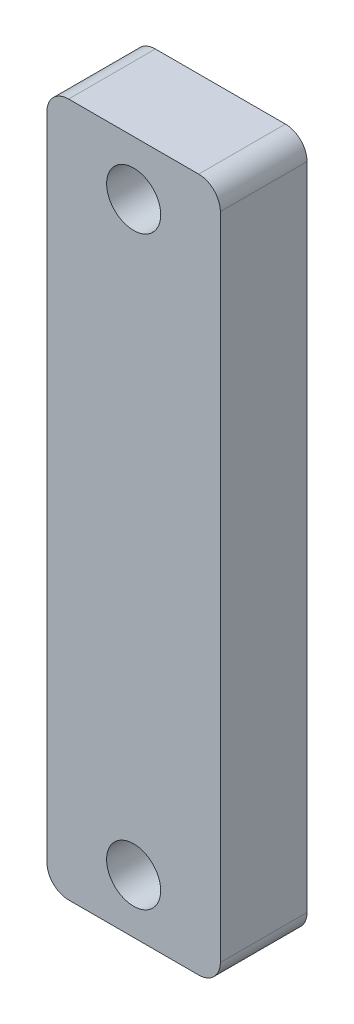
ISO-10303-21;
HEADER;
FILE_DESCRIPTION(('STEP AP214'),'2;1');
FILE_NAME('part.step','',(''),(''),'','','');
FILE_SCHEMA(('AUTOMOTIVE_DESIGN { 1 0 10303 214 1 1 1 1 }'));
ENDSEC;
DATA;
#1=APPLICATION_CONTEXT('core data for automotive mechanical design processes');
#2=APPLICATION_PROTOCOL_DEFINITION('international standard','automotive_design',2000,#1);
#3=PRODUCT_CONTEXT('',#1,'mechanical');
#4=PRODUCT('Part','Part','',(#3));
#5=PRODUCT_RELATED_PRODUCT_CATEGORY('part','',(#4));
#6=PRODUCT_DEFINITION_FORMATION('','',#4);
#7=PRODUCT_DEFINITION_CONTEXT('part definition',#1,'design');
#8=PRODUCT_DEFINITION('design','',#6,#7);
#9=PRODUCT_DEFINITION_SHAPE('','',#8);
#10=(LENGTH_UNIT() NAMED_UNIT(*) SI_UNIT(.MILLI.,.METRE.));
#11=(NAMED_UNIT(*) PLANE_ANGLE_UNIT() SI_UNIT($,.RADIAN.));
#12=(NAMED_UNIT(*) SI_UNIT($,.STERADIAN.) SOLID_ANGLE_UNIT());
#13=UNCERTAINTY_MEASURE_WITH_UNIT(LENGTH_MEASURE(1.E-05),#10,'distance_accuracy_value','');
#14=(GEOMETRIC_REPRESENTATION_CONTEXT(3) GLOBAL_UNCERTAINTY_ASSIGNED_CONTEXT((#13)) GLOBAL_UNIT_ASSIGNED_CONTEXT((#10,
#11,#12)) REPRESENTATION_CONTEXT('',''));
#15=CARTESIAN_POINT('',(0.,0.,0.));
#16=DIRECTION('',(0.,0.,1.));
#17=DIRECTION('',(1.,0.,0.));
#18=AXIS2_PLACEMENT_3D('',#15,#16,#17);
#19=CARTESIAN_POINT('',(0.,0.,12.7));
#20=DIRECTION('',(0.,0.,1.));
#21=DIRECTION('',(1.,0.,0.));
#22=AXIS2_PLACEMENT_3D('',#19,#20,#21);
#23=PLANE('',#22);
#24=CARTESIAN_POINT('',(12.7,7.9248,12.7));
#25=DIRECTION('',(0.,0.,1.));
#26=DIRECTION('',(1.,0.,0.));
#27=AXIS2_PLACEMENT_3D('',#24,#25,#26);
#28=CIRCLE('',#27,3.9624);
#29=CARTESIAN_POINT('',(16.6624,7.9248,12.7));
#30=VERTEX_POINT('',#29);
#31=EDGE_CURVE('E178',#30,#30,#28,.T.);
#32=ORIENTED_EDGE('',*,*,#31,.F.);
#33=EDGE_LOOP('',(#32));
#34=FACE_BOUND('',#33,.T.);
#35=DIRECTION('',(1.,0.,0.));
#36=VECTOR('',#35,1.);
#37=CARTESIAN_POINT('',(0.,0.,12.7));
#38=LINE('',#37,#36);
#39=CARTESIAN_POINT('',(3.175,0.,12.7));
#40=VERTEX_POINT('',#39);
#41=CARTESIAN_POINT('',(22.225,0.,12.7));
#42=VERTEX_POINT('',#41);
#43=EDGE_CURVE('E169',#40,#42,#38,.T.);
#44=ORIENTED_EDGE('',*,*,#43,.T.);
#45=CARTESIAN_POINT('',(22.225,3.175,12.7));
#46=DIRECTION('',(0.,0.,1.));
#47=DIRECTION('',(1.,0.,0.));
#48=AXIS2_PLACEMENT_3D('',#45,#46,#47);
#49=CIRCLE('',#48,3.175);
#50=CARTESIAN_POINT('',(25.4,3.175,12.7));
#51=VERTEX_POINT('',#50);
#52=EDGE_CURVE('E147',#42,#51,#49,.T.);
#53=ORIENTED_EDGE('',*,*,#52,.T.);
#54=DIRECTION('',(0.,1.,0.));
#55=VECTOR('',#54,1.);
#56=CARTESIAN_POINT('',(25.4,0.,12.7));
#57=LINE('',#56,#55);
#58=CARTESIAN_POINT('',(25.4,98.425,12.7));
#59=VERTEX_POINT('',#58);
#60=EDGE_CURVE('E117',#51,#59,#57,.T.);
#61=ORIENTED_EDGE('',*,*,#60,.T.);
#62=CARTESIAN_POINT('',(22.225,98.425,12.7));
#63=DIRECTION('',(0.,0.,1.));
#64=DIRECTION('',(1.,0.,0.));
#65=AXIS2_PLACEMENT_3D('',#62,#63,#64);
#66=CIRCLE('',#65,3.175);
#67=CARTESIAN_POINT('',(22.225,101.6,12.7));
#68=VERTEX_POINT('',#67);
#69=EDGE_CURVE('E53',#59,#68,#66,.T.);
#70=ORIENTED_EDGE('',*,*,#69,.T.);
#71=DIRECTION('',(-1.,0.,0.));
#72=VECTOR('',#71,1.);
#73=CARTESIAN_POINT('',(25.4,101.6,12.7));
#74=LINE('',#73,#72);
#75=CARTESIAN_POINT('',(3.175,101.6,12.7));
#76=VERTEX_POINT('',#75);
#77=EDGE_CURVE('E133',#68,#76,#74,.T.);
#78=ORIENTED_EDGE('',*,*,#77,.T.);
#79=CARTESIAN_POINT('',(3.175,98.425,12.7));
#80=DIRECTION('',(0.,0.,1.));
#81=DIRECTION('',(1.,0.,0.));
#82=AXIS2_PLACEMENT_3D('',#79,#80,#81);
#83=CIRCLE('',#82,3.175);
#84=CARTESIAN_POINT('',(0.,98.425,12.7));
#85=VERTEX_POINT('',#84);
#86=EDGE_CURVE('E143',#76,#85,#83,.T.);
#87=ORIENTED_EDGE('',*,*,#86,.T.);
#88=DIRECTION('',(0.,-1.,0.));
#89=VECTOR('',#88,1.);
#90=CARTESIAN_POINT('',(0.,101.6,12.7));
#91=LINE('',#90,#89);
#92=CARTESIAN_POINT('',(0.,3.175,12.7));
#93=VERTEX_POINT('',#92);
#94=EDGE_CURVE('E127',#85,#93,#91,.T.);
#95=ORIENTED_EDGE('',*,*,#94,.T.);
#96=CARTESIAN_POINT('',(3.175,3.175,12.7));
#97=DIRECTION('',(0.,0.,1.));
#98=DIRECTION('',(1.,0.,0.));
#99=AXIS2_PLACEMENT_3D('',#96,#97,#98);
#100=CIRCLE('',#99,3.175);
#101=EDGE_CURVE('E145',#93,#40,#100,.T.);
#102=ORIENTED_EDGE('',*,*,#101,.T.);
#103=EDGE_LOOP('',(#44,#53,#61,#70,#78,#87,#95,#102));
#104=FACE_BOUND('',#103,.T.);
#105=CARTESIAN_POINT('',(12.7,93.6498,12.7));
#106=DIRECTION('',(0.,0.,1.));
#107=DIRECTION('',(1.,0.,0.));
#108=AXIS2_PLACEMENT_3D('',#105,#106,#107);
#109=CIRCLE('',#108,3.96239999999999);
#110=CARTESIAN_POINT('',(16.6624,93.6498,12.7));
#111=VERTEX_POINT('',#110);
#112=EDGE_CURVE('E183',#111,#111,#109,.T.);
#113=ORIENTED_EDGE('',*,*,#112,.F.);
#114=EDGE_LOOP('',(#113));
#115=FACE_BOUND('',#114,.T.);
#116=ADVANCED_FACE('F33',(#34,#104,#115),#23,.T.);
#117=CARTESIAN_POINT('',(0.,0.,0.));
#118=DIRECTION('',(0.,0.,1.));
#119=DIRECTION('',(1.,0.,0.));
#120=AXIS2_PLACEMENT_3D('',#117,#118,#119);
#121=PLANE('',#120);
#122=CARTESIAN_POINT('',(12.7,7.9248,0.));
#123=DIRECTION('',(0.,0.,1.));
#124=DIRECTION('',(1.,0.,0.));
#125=AXIS2_PLACEMENT_3D('',#122,#123,#124);
#126=CIRCLE('',#125,3.9624);
#127=CARTESIAN_POINT('',(16.6624,7.9248,0.));
#128=VERTEX_POINT('',#127);
#129=EDGE_CURVE('E174',#128,#128,#126,.T.);
#130=ORIENTED_EDGE('',*,*,#129,.T.);
#131=EDGE_LOOP('',(#130));
#132=FACE_BOUND('',#131,.T.);
#133=DIRECTION('',(0.,1.,0.));
#134=VECTOR('',#133,1.);
#135=CARTESIAN_POINT('',(25.4,0.,0.));
#136=LINE('',#135,#134);
#137=CARTESIAN_POINT('',(25.4,3.175,0.));
#138=VERTEX_POINT('',#137);
#139=CARTESIAN_POINT('',(25.4,98.425,0.));
#140=VERTEX_POINT('',#139);
#141=EDGE_CURVE('E115',#138,#140,#136,.T.);
#142=ORIENTED_EDGE('',*,*,#141,.F.);
#143=CARTESIAN_POINT('',(22.225,3.175,0.));
#144=DIRECTION('',(0.,0.,1.));
#145=DIRECTION('',(1.,0.,0.));
#146=AXIS2_PLACEMENT_3D('',#143,#144,#145);
#147=CIRCLE('',#146,3.175);
#148=CARTESIAN_POINT('',(22.225,0.,0.));
#149=VERTEX_POINT('',#148);
#150=EDGE_CURVE('E98',#138,#149,#147,.F.);
#151=ORIENTED_EDGE('',*,*,#150,.T.);
#152=DIRECTION('',(1.,0.,0.));
#153=VECTOR('',#152,1.);
#154=CARTESIAN_POINT('',(0.,0.,0.));
#155=LINE('',#154,#153);
#156=CARTESIAN_POINT('',(3.175,0.,0.));
#157=VERTEX_POINT('',#156);
#158=EDGE_CURVE('E125',#157,#149,#155,.T.);
#159=ORIENTED_EDGE('',*,*,#158,.F.);
#160=CARTESIAN_POINT('',(3.175,3.175,0.));
#161=DIRECTION('',(0.,0.,1.));
#162=DIRECTION('',(1.,0.,0.));
#163=AXIS2_PLACEMENT_3D('',#160,#161,#162);
#164=CIRCLE('',#163,3.175);
#165=CARTESIAN_POINT('',(0.,3.175,0.));
#166=VERTEX_POINT('',#165);
#167=EDGE_CURVE('E109',#157,#166,#164,.F.);
#168=ORIENTED_EDGE('',*,*,#167,.T.);
#169=DIRECTION('',(0.,-1.,0.));
#170=VECTOR('',#169,1.);
#171=CARTESIAN_POINT('',(0.,101.6,0.));
#172=LINE('',#171,#170);
#173=CARTESIAN_POINT('',(0.,98.425,0.));
#174=VERTEX_POINT('',#173);
#175=EDGE_CURVE('E129',#174,#166,#172,.T.);
#176=ORIENTED_EDGE('',*,*,#175,.F.);
#177=CARTESIAN_POINT('',(3.175,98.425,0.));
#178=DIRECTION('',(0.,0.,1.));
#179=DIRECTION('',(1.,0.,0.));
#180=AXIS2_PLACEMENT_3D('',#177,#178,#179);
#181=CIRCLE('',#180,3.175);
#182=CARTESIAN_POINT('',(3.175,101.6,0.));
#183=VERTEX_POINT('',#182);
#184=EDGE_CURVE('E136',#174,#183,#181,.F.);
#185=ORIENTED_EDGE('',*,*,#184,.T.);
#186=DIRECTION('',(-1.,0.,0.));
#187=VECTOR('',#186,1.);
#188=CARTESIAN_POINT('',(25.4,101.6,0.));
#189=LINE('',#188,#187);
#190=CARTESIAN_POINT('',(22.225,101.6,0.));
#191=VERTEX_POINT('',#190);
#192=EDGE_CURVE('E124',#191,#183,#189,.T.);
#193=ORIENTED_EDGE('',*,*,#192,.F.);
#194=CARTESIAN_POINT('',(22.225,98.425,0.));
#195=DIRECTION('',(0.,0.,1.));
#196=DIRECTION('',(1.,0.,0.));
#197=AXIS2_PLACEMENT_3D('',#194,#195,#196);
#198=CIRCLE('',#197,3.175);
#199=EDGE_CURVE('E118',#191,#140,#198,.F.);
#200=ORIENTED_EDGE('',*,*,#199,.T.);
#201=EDGE_LOOP('',(#142,#151,#159,#168,#176,#185,#193,#200));
#202=FACE_BOUND('',#201,.T.);
#203=CARTESIAN_POINT('',(12.7,93.6498,0.));
#204=DIRECTION('',(0.,0.,1.));
#205=DIRECTION('',(1.,0.,0.));
#206=AXIS2_PLACEMENT_3D('',#203,#204,#205);
#207=CIRCLE('',#206,3.96239999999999);
#208=CARTESIAN_POINT('',(16.6624,93.6498,0.));
#209=VERTEX_POINT('',#208);
#210=EDGE_CURVE('E185',#209,#209,#207,.T.);
#211=ORIENTED_EDGE('',*,*,#210,.T.);
#212=EDGE_LOOP('',(#211));
#213=FACE_BOUND('',#212,.T.);
#214=ADVANCED_FACE('F121',(#132,#202,#213),#121,.F.);
#215=CARTESIAN_POINT('',(0.,101.6,12.7));
#216=DIRECTION('',(1.,0.,0.));
#217=DIRECTION('',(0.,0.,-1.));
#218=AXIS2_PLACEMENT_3D('',#215,#216,#217);
#219=PLANE('',#218);
#220=ORIENTED_EDGE('',*,*,#175,.T.);
#221=DIRECTION('',(0.,0.,-1.));
#222=VECTOR('',#221,1.);
#223=CARTESIAN_POINT('',(0.,3.175,12.7));
#224=LINE('',#223,#222);
#225=EDGE_CURVE('E152',#166,#93,#224,.F.);
#226=ORIENTED_EDGE('',*,*,#225,.T.);
#227=ORIENTED_EDGE('',*,*,#94,.F.);
#228=DIRECTION('',(0.,0.,-1.));
#229=VECTOR('',#228,1.);
#230=CARTESIAN_POINT('',(0.,98.425,12.7));
#231=LINE('',#230,#229);
#232=EDGE_CURVE('E149',#85,#174,#231,.T.);
#233=ORIENTED_EDGE('',*,*,#232,.T.);
#234=EDGE_LOOP('',(#220,#226,#227,#233));
#235=FACE_BOUND('',#234,.T.);
#236=ADVANCED_FACE('F165',(#235),#219,.F.);
#237=CARTESIAN_POINT('',(0.,0.,12.7));
#238=DIRECTION('',(0.,1.,0.));
#239=DIRECTION('',(0.,0.,1.));
#240=AXIS2_PLACEMENT_3D('',#237,#238,#239);
#241=PLANE('',#240);
#242=ORIENTED_EDGE('',*,*,#158,.T.);
#243=DIRECTION('',(0.,0.,-1.));
#244=VECTOR('',#243,1.);
#245=CARTESIAN_POINT('',(22.225,0.,12.7));
#246=LINE('',#245,#244);
#247=EDGE_CURVE('E103',#149,#42,#246,.F.);
#248=ORIENTED_EDGE('',*,*,#247,.T.);
#249=ORIENTED_EDGE('',*,*,#43,.F.);
#250=DIRECTION('',(0.,0.,-1.));
#251=VECTOR('',#250,1.);
#252=CARTESIAN_POINT('',(3.175,0.,12.7));
#253=LINE('',#252,#251);
#254=EDGE_CURVE('E108',#40,#157,#253,.T.);
#255=ORIENTED_EDGE('',*,*,#254,.T.);
#256=EDGE_LOOP('',(#242,#248,#249,#255));
#257=FACE_BOUND('',#256,.T.);
#258=ADVANCED_FACE('F210',(#257),#241,.F.);
#259=CARTESIAN_POINT('',(25.4,0.,12.7));
#260=DIRECTION('',(-1.,0.,0.));
#261=DIRECTION('',(0.,0.,1.));
#262=AXIS2_PLACEMENT_3D('',#259,#260,#261);
#263=PLANE('',#262);
#264=ORIENTED_EDGE('',*,*,#60,.F.);
#265=DIRECTION('',(0.,0.,-1.));
#266=VECTOR('',#265,1.);
#267=CARTESIAN_POINT('',(25.4,3.175,12.7));
#268=LINE('',#267,#266);
#269=EDGE_CURVE('E102',#51,#138,#268,.T.);
#270=ORIENTED_EDGE('',*,*,#269,.T.);
#271=ORIENTED_EDGE('',*,*,#141,.T.);
#272=DIRECTION('',(0.,0.,-1.));
#273=VECTOR('',#272,1.);
#274=CARTESIAN_POINT('',(25.4,98.425,12.7));
#275=LINE('',#274,#273);
#276=EDGE_CURVE('E119',#140,#59,#275,.F.);
#277=ORIENTED_EDGE('',*,*,#276,.T.);
#278=EDGE_LOOP('',(#264,#270,#271,#277));
#279=FACE_BOUND('',#278,.T.);
#280=ADVANCED_FACE('F114',(#279),#263,.F.);
#281=CARTESIAN_POINT('',(25.4,101.6,12.7));
#282=DIRECTION('',(0.,-1.,0.));
#283=DIRECTION('',(0.,0.,-1.));
#284=AXIS2_PLACEMENT_3D('',#281,#282,#283);
#285=PLANE('',#284);
#286=ORIENTED_EDGE('',*,*,#192,.T.);
#287=DIRECTION('',(0.,0.,-1.));
#288=VECTOR('',#287,1.);
#289=CARTESIAN_POINT('',(3.175,101.6,12.7));
#290=LINE('',#289,#288);
#291=EDGE_CURVE('E11',#183,#76,#290,.F.);
#292=ORIENTED_EDGE('',*,*,#291,.T.);
#293=ORIENTED_EDGE('',*,*,#77,.F.);
#294=DIRECTION('',(0.,0.,-1.));
#295=VECTOR('',#294,1.);
#296=CARTESIAN_POINT('',(22.225,101.6,12.7));
#297=LINE('',#296,#295);
#298=EDGE_CURVE('E41',#68,#191,#297,.T.);
#299=ORIENTED_EDGE('',*,*,#298,.T.);
#300=EDGE_LOOP('',(#286,#292,#293,#299));
#301=FACE_BOUND('',#300,.T.);
#302=ADVANCED_FACE('F155',(#301),#285,.F.);
#303=CARTESIAN_POINT('',(12.7,7.9248,12.7));
#304=DIRECTION('',(0.,0.,-1.));
#305=DIRECTION('',(-1.,0.,0.));
#306=AXIS2_PLACEMENT_3D('',#303,#304,#305);
#307=CYLINDRICAL_SURFACE('',#306,3.9624);
#308=ORIENTED_EDGE('',*,*,#31,.T.);
#309=EDGE_LOOP('',(#308));
#310=FACE_BOUND('',#309,.T.);
#311=ORIENTED_EDGE('',*,*,#129,.F.);
#312=EDGE_LOOP('',(#311));
#313=FACE_BOUND('',#312,.T.);
#314=ADVANCED_FACE('F203',(#310,#313),#307,.F.);
#315=CARTESIAN_POINT('',(12.7,93.6498,12.7));
#316=DIRECTION('',(0.,0.,-1.));
#317=DIRECTION('',(-1.,0.,0.));
#318=AXIS2_PLACEMENT_3D('',#315,#316,#317);
#319=CYLINDRICAL_SURFACE('',#318,3.96239999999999);
#320=ORIENTED_EDGE('',*,*,#112,.T.);
#321=EDGE_LOOP('',(#320));
#322=FACE_BOUND('',#321,.T.);
#323=ORIENTED_EDGE('',*,*,#210,.F.);
#324=EDGE_LOOP('',(#323));
#325=FACE_BOUND('',#324,.T.);
#326=ADVANCED_FACE('F191',(#322,#325),#319,.F.);
#327=CARTESIAN_POINT('',(22.225,3.175,12.7));
#328=DIRECTION('',(0.,0.,-1.));
#329=DIRECTION('',(-1.,0.,0.));
#330=AXIS2_PLACEMENT_3D('',#327,#328,#329);
#331=CYLINDRICAL_SURFACE('',#330,3.175);
#332=ORIENTED_EDGE('',*,*,#52,.F.);
#333=ORIENTED_EDGE('',*,*,#247,.F.);
#334=ORIENTED_EDGE('',*,*,#150,.F.);
#335=ORIENTED_EDGE('',*,*,#269,.F.);
#336=EDGE_LOOP('',(#332,#333,#334,#335));
#337=FACE_BOUND('',#336,.T.);
#338=ADVANCED_FACE('F101',(#337),#331,.T.);
#339=CARTESIAN_POINT('',(3.175,3.175,12.7));
#340=DIRECTION('',(0.,0.,-1.));
#341=DIRECTION('',(-1.,0.,0.));
#342=AXIS2_PLACEMENT_3D('',#339,#340,#341);
#343=CYLINDRICAL_SURFACE('',#342,3.175);
#344=ORIENTED_EDGE('',*,*,#101,.F.);
#345=ORIENTED_EDGE('',*,*,#225,.F.);
#346=ORIENTED_EDGE('',*,*,#167,.F.);
#347=ORIENTED_EDGE('',*,*,#254,.F.);
#348=EDGE_LOOP('',(#344,#345,#346,#347));
#349=FACE_BOUND('',#348,.T.);
#350=ADVANCED_FACE('F218',(#349),#343,.T.);
#351=CARTESIAN_POINT('',(3.175,98.425,12.7));
#352=DIRECTION('',(0.,0.,-1.));
#353=DIRECTION('',(-1.,0.,0.));
#354=AXIS2_PLACEMENT_3D('',#351,#352,#353);
#355=CYLINDRICAL_SURFACE('',#354,3.175);
#356=ORIENTED_EDGE('',*,*,#86,.F.);
#357=ORIENTED_EDGE('',*,*,#291,.F.);
#358=ORIENTED_EDGE('',*,*,#184,.F.);
#359=ORIENTED_EDGE('',*,*,#232,.F.);
#360=EDGE_LOOP('',(#356,#357,#358,#359));
#361=FACE_BOUND('',#360,.T.);
#362=ADVANCED_FACE('F162',(#361),#355,.T.);
#363=CARTESIAN_POINT('',(22.225,98.425,12.7));
#364=DIRECTION('',(0.,0.,-1.));
#365=DIRECTION('',(-1.,0.,0.));
#366=AXIS2_PLACEMENT_3D('',#363,#364,#365);
#367=CYLINDRICAL_SURFACE('',#366,3.175);
#368=ORIENTED_EDGE('',*,*,#69,.F.);
#369=ORIENTED_EDGE('',*,*,#276,.F.);
#370=ORIENTED_EDGE('',*,*,#199,.F.);
#371=ORIENTED_EDGE('',*,*,#298,.F.);
#372=EDGE_LOOP('',(#368,#369,#370,#371));
#373=FACE_BOUND('',#372,.T.);
#374=ADVANCED_FACE('F35',(#373),#367,.T.);
#375=CLOSED_SHELL('',(#116,#214,#236,#258,#280,#302,#314,#326,#338,#350,#362,#374));
#376=MANIFOLD_SOLID_BREP('B2',#375);
#377=ADVANCED_BREP_SHAPE_REPRESENTATION('',(#18,#376),#14);
#378=SHAPE_DEFINITION_REPRESENTATION(#9,#377);
ENDSEC;
END-ISO-10303-21;
